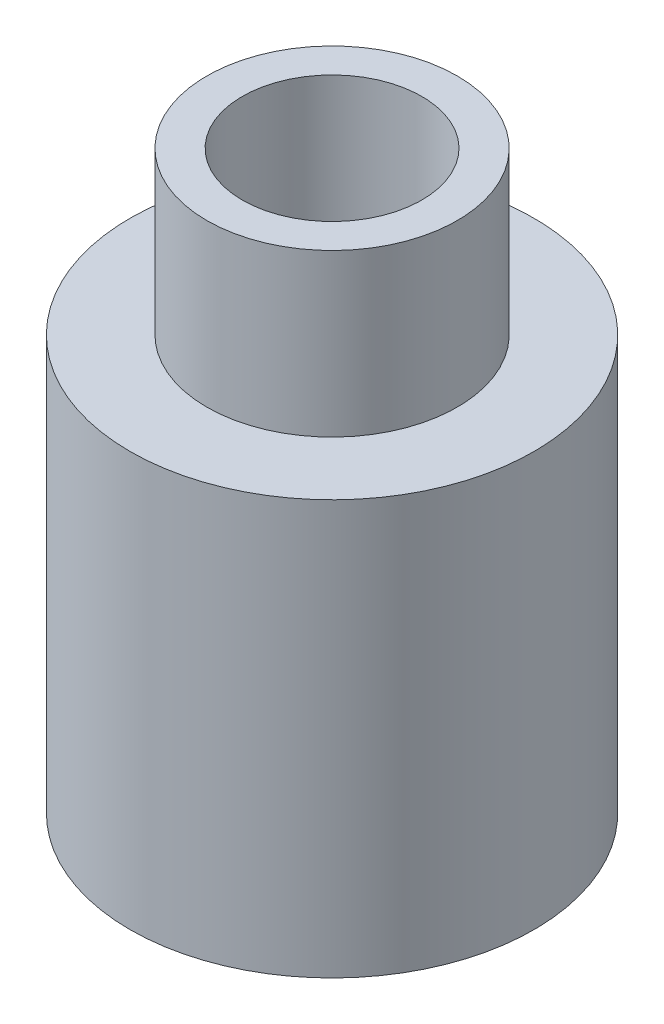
ISO-10303-21;
HEADER;
FILE_DESCRIPTION(('STEP AP214'),'2;1');
FILE_NAME('part.step','',(''),(''),'','','');
FILE_SCHEMA(('AUTOMOTIVE_DESIGN { 1 0 10303 214 1 1 1 1 }'));
ENDSEC;
DATA;
#1=APPLICATION_CONTEXT('core data for automotive mechanical design processes');
#2=APPLICATION_PROTOCOL_DEFINITION('international standard','automotive_design',2000,#1);
#3=PRODUCT_CONTEXT('',#1,'mechanical');
#4=PRODUCT('Part','Part','',(#3));
#5=PRODUCT_RELATED_PRODUCT_CATEGORY('part','',(#4));
#6=PRODUCT_DEFINITION_FORMATION('','',#4);
#7=PRODUCT_DEFINITION_CONTEXT('part definition',#1,'design');
#8=PRODUCT_DEFINITION('design','',#6,#7);
#9=PRODUCT_DEFINITION_SHAPE('','',#8);
#10=(LENGTH_UNIT() NAMED_UNIT(*) SI_UNIT(.MILLI.,.METRE.));
#11=(NAMED_UNIT(*) PLANE_ANGLE_UNIT() SI_UNIT($,.RADIAN.));
#12=(NAMED_UNIT(*) SI_UNIT($,.STERADIAN.) SOLID_ANGLE_UNIT());
#13=UNCERTAINTY_MEASURE_WITH_UNIT(LENGTH_MEASURE(1.E-05),#10,'distance_accuracy_value','');
#14=(GEOMETRIC_REPRESENTATION_CONTEXT(3) GLOBAL_UNCERTAINTY_ASSIGNED_CONTEXT((#13)) GLOBAL_UNIT_ASSIGNED_CONTEXT((#10,
#11,#12)) REPRESENTATION_CONTEXT('',''));
#15=CARTESIAN_POINT('',(0.,0.,0.));
#16=DIRECTION('',(0.,0.,1.));
#17=DIRECTION('',(1.,0.,0.));
#18=AXIS2_PLACEMENT_3D('',#15,#16,#17);
#19=CARTESIAN_POINT('',(0.,4.1,0.));
#20=DIRECTION('',(0.,-1.,0.));
#21=DIRECTION('',(0.,0.,-1.));
#22=AXIS2_PLACEMENT_3D('',#19,#20,#21);
#23=CYLINDRICAL_SURFACE('',#22,2.);
#24=CARTESIAN_POINT('',(0.,4.1,0.));
#25=DIRECTION('',(0.,1.,0.));
#26=DIRECTION('',(0.,0.,1.));
#27=AXIS2_PLACEMENT_3D('',#24,#25,#26);
#28=CIRCLE('',#27,2.);
#29=CARTESIAN_POINT('',(0.,4.1,2.));
#30=VERTEX_POINT('',#29);
#31=EDGE_CURVE('E42',#30,#30,#28,.T.);
#32=ORIENTED_EDGE('',*,*,#31,.F.);
#33=EDGE_LOOP('',(#32));
#34=FACE_BOUND('',#33,.T.);
#35=CARTESIAN_POINT('',(0.,0.,0.));
#36=DIRECTION('',(0.,1.,0.));
#37=DIRECTION('',(0.,0.,1.));
#38=AXIS2_PLACEMENT_3D('',#35,#36,#37);
#39=CIRCLE('',#38,2.);
#40=CARTESIAN_POINT('',(0.,0.,2.));
#41=VERTEX_POINT('',#40);
#42=EDGE_CURVE('E38',#41,#41,#39,.T.);
#43=ORIENTED_EDGE('',*,*,#42,.T.);
#44=EDGE_LOOP('',(#43));
#45=FACE_BOUND('',#44,.T.);
#46=ADVANCED_FACE('F35',(#34,#45),#23,.T.);
#47=CARTESIAN_POINT('',(0.,4.1,0.));
#48=DIRECTION('',(0.,1.,0.));
#49=DIRECTION('',(0.,0.,1.));
#50=AXIS2_PLACEMENT_3D('',#47,#48,#49);
#51=PLANE('',#50);
#52=CARTESIAN_POINT('',(0.,4.1,0.));
#53=DIRECTION('',(0.,1.,0.));
#54=DIRECTION('',(0.,0.,1.));
#55=AXIS2_PLACEMENT_3D('',#52,#53,#54);
#56=CIRCLE('',#55,1.24);
#57=CARTESIAN_POINT('',(0.,4.1,1.24));
#58=VERTEX_POINT('',#57);
#59=EDGE_CURVE('E11',#58,#58,#56,.T.);
#60=ORIENTED_EDGE('',*,*,#59,.F.);
#61=EDGE_LOOP('',(#60));
#62=FACE_BOUND('',#61,.T.);
#63=ORIENTED_EDGE('',*,*,#31,.T.);
#64=EDGE_LOOP('',(#63));
#65=FACE_BOUND('',#64,.T.);
#66=ADVANCED_FACE('F73',(#62,#65),#51,.T.);
#67=CARTESIAN_POINT('',(0.,0.,0.));
#68=DIRECTION('',(0.,1.,0.));
#69=DIRECTION('',(0.,0.,1.));
#70=AXIS2_PLACEMENT_3D('',#67,#68,#69);
#71=PLANE('',#70);
#72=ORIENTED_EDGE('',*,*,#42,.F.);
#73=EDGE_LOOP('',(#72));
#74=FACE_BOUND('',#73,.T.);
#75=ADVANCED_FACE('F70',(#74),#71,.F.);
#76=CARTESIAN_POINT('',(0.,5.7,0.));
#77=DIRECTION('',(0.,-1.,0.));
#78=DIRECTION('',(0.,0.,-1.));
#79=AXIS2_PLACEMENT_3D('',#76,#77,#78);
#80=CYLINDRICAL_SURFACE('',#79,1.24);
#81=CARTESIAN_POINT('',(0.,5.7,0.));
#82=DIRECTION('',(0.,1.,0.));
#83=DIRECTION('',(0.,0.,1.));
#84=AXIS2_PLACEMENT_3D('',#81,#82,#83);
#85=CIRCLE('',#84,1.24);
#86=CARTESIAN_POINT('',(0.,5.7,1.24));
#87=VERTEX_POINT('',#86);
#88=EDGE_CURVE('E56',#87,#87,#85,.T.);
#89=ORIENTED_EDGE('',*,*,#88,.F.);
#90=EDGE_LOOP('',(#89));
#91=FACE_BOUND('',#90,.T.);
#92=ORIENTED_EDGE('',*,*,#59,.T.);
#93=EDGE_LOOP('',(#92));
#94=FACE_BOUND('',#93,.T.);
#95=ADVANCED_FACE('F72',(#91,#94),#80,.T.);
#96=CARTESIAN_POINT('',(0.,5.7,0.));
#97=DIRECTION('',(0.,1.,0.));
#98=DIRECTION('',(0.,0.,1.));
#99=AXIS2_PLACEMENT_3D('',#96,#97,#98);
#100=PLANE('',#99);
#101=CARTESIAN_POINT('',(0.,5.7,0.));
#102=DIRECTION('',(0.,1.,0.));
#103=DIRECTION('',(0.,0.,1.));
#104=AXIS2_PLACEMENT_3D('',#101,#102,#103);
#105=CIRCLE('',#104,0.888999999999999);
#106=CARTESIAN_POINT('',(0.,5.7,0.888999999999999));
#107=VERTEX_POINT('',#106);
#108=EDGE_CURVE('E57',#107,#107,#105,.T.);
#109=ORIENTED_EDGE('',*,*,#108,.F.);
#110=EDGE_LOOP('',(#109));
#111=FACE_BOUND('',#110,.T.);
#112=ORIENTED_EDGE('',*,*,#88,.T.);
#113=EDGE_LOOP('',(#112));
#114=FACE_BOUND('',#113,.T.);
#115=ADVANCED_FACE('F50',(#111,#114),#100,.T.);
#116=CARTESIAN_POINT('',(0.,2.525,0.));
#117=DIRECTION('',(0.,1.,0.));
#118=DIRECTION('',(0.,0.,1.));
#119=AXIS2_PLACEMENT_3D('',#116,#117,#118);
#120=CONICAL_SURFACE('',#119,0.888999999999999,1.02974425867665);
#121=CARTESIAN_POINT('',(0.,1.9908349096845,0.));
#122=VERTEX_POINT('',#121);
#123=VERTEX_LOOP('',#122);
#124=FACE_BOUND('',#123,.T.);
#125=CARTESIAN_POINT('',(0.,2.525,0.));
#126=DIRECTION('',(0.,1.,0.));
#127=DIRECTION('',(0.,0.,1.));
#128=AXIS2_PLACEMENT_3D('',#125,#126,#127);
#129=CIRCLE('',#128,0.888999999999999);
#130=CARTESIAN_POINT('',(0.,2.525,0.888999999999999));
#131=VERTEX_POINT('',#130);
#132=EDGE_CURVE('E54',#131,#131,#129,.T.);
#133=ORIENTED_EDGE('',*,*,#132,.T.);
#134=EDGE_LOOP('',(#133));
#135=FACE_BOUND('',#134,.T.);
#136=ADVANCED_FACE('F46',(#124,#135),#120,.F.);
#137=CARTESIAN_POINT('',(0.,5.7,0.));
#138=DIRECTION('',(0.,1.,0.));
#139=DIRECTION('',(0.,0.,1.));
#140=AXIS2_PLACEMENT_3D('',#137,#138,#139);
#141=CYLINDRICAL_SURFACE('',#140,0.888999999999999);
#142=ORIENTED_EDGE('',*,*,#132,.F.);
#143=EDGE_LOOP('',(#142));
#144=FACE_BOUND('',#143,.T.);
#145=ORIENTED_EDGE('',*,*,#108,.T.);
#146=EDGE_LOOP('',(#145));
#147=FACE_BOUND('',#146,.T.);
#148=ADVANCED_FACE('F49',(#144,#147),#141,.F.);
#149=CLOSED_SHELL('',(#46,#66,#75,#95,#115,#136,#148));
#150=MANIFOLD_SOLID_BREP('B2',#149);
#151=ADVANCED_BREP_SHAPE_REPRESENTATION('',(#18,#150),#14);
#152=SHAPE_DEFINITION_REPRESENTATION(#9,#151);
ENDSEC;
END-ISO-10303-21;
